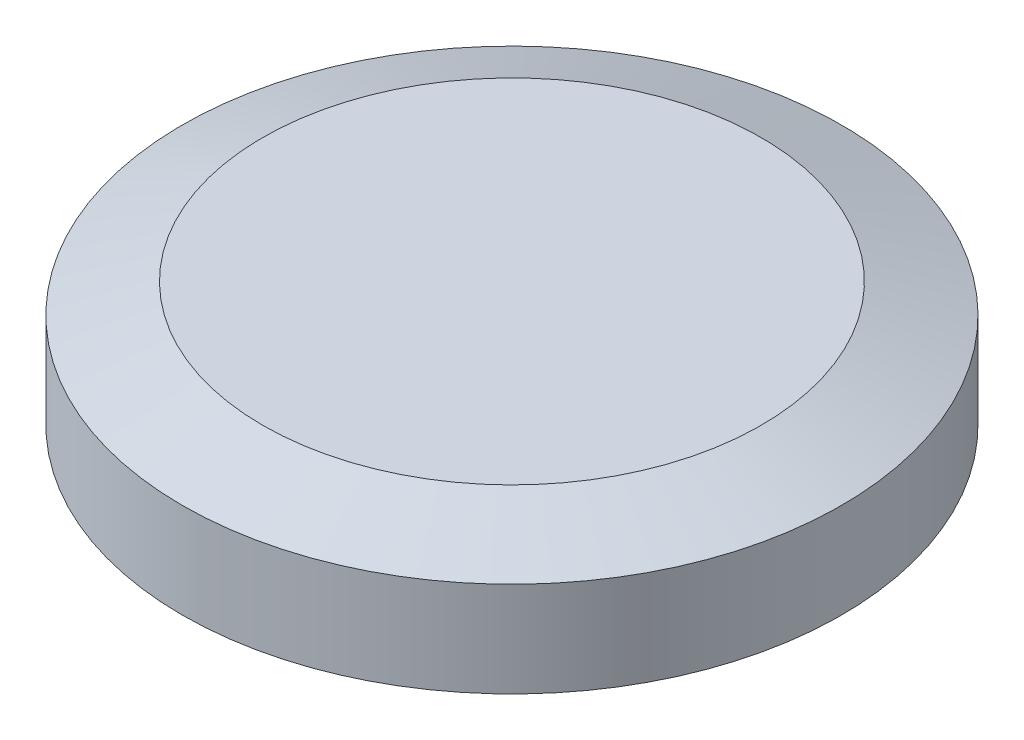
from build123d import *


with BuildPart() as part:
    # Sketch1 → Revolve1 (revolve)
    with BuildSketch(Plane.XY, mode=Mode.PRIVATE) as revolve1_sk:
        with BuildLine():
            Line((0, 0), (-8.275866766, 0))
            ThreePointArc((-8.275866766, 0), (-8.577191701, 0.059937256), (-8.832642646, 0.23062412))
            Line((-8.832642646, 0.23062412), (-9.584303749, 0.982285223))
            ThreePointArc((-9.584303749, 0.982285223), (-10.37785349, 1.18469033), (-10.922, 0.572649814))
            Line((-10.922, 0.572649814), (-10.922, -0.889))
            Line((-10.922, -0.889), (-12.5984, -0.889))
            Line((-12.5984, -0.889), (-12.5984, 2.7432))
            Line((-12.5984, 2.7432), (-9.527819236, 3.8608))
            Line((-9.527819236, 3.8608), (0, 3.8608))
            Line((0, 3.8608), (0, 0))
        make_face()
    revolve(revolve1_sk.sketch.rotate(Axis((0, 3.8608, 0), (0, -1, 0)), 270), axis=Axis((0, 3.8608, 0), (0, -1, 0)))


solid = part.part
